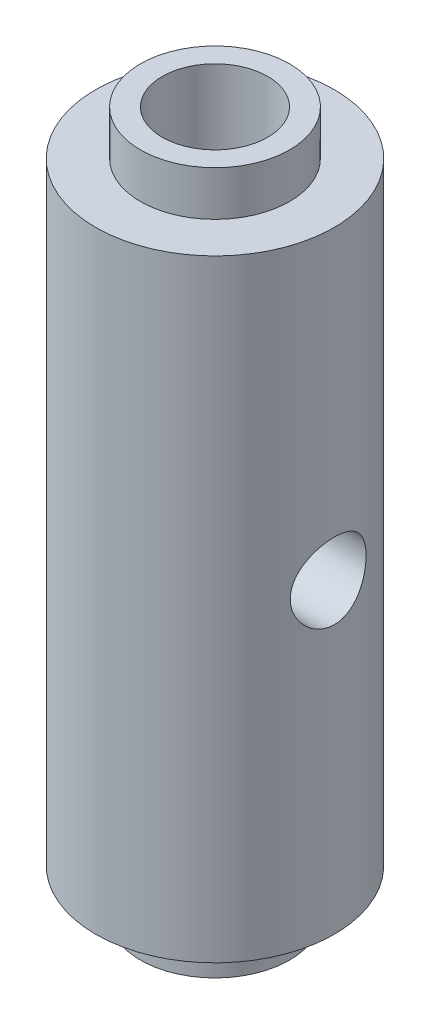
from build123d import *

# Parameters (mm, degrees)
SKETCH12_R         = 2.8067
CUT_EXTRUDE1_DEPTH = 39.402750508


with BuildPart() as part:
    # PostHeight → Height (revolve)
    with BuildSketch(Plane.XY, mode=Mode.PRIVATE) as height_sk:
        Polygon((0, 37.338), (-3.96875, 37.338), (-3.96875, 34.95675), (-6.35, 34.95675), (-6.35, 2.38125), (-3.96875, 2.38125), (-3.96875, 0), (0, 0), align=None)
    revolve(height_sk.sketch.rotate(Axis((0, 0, 0), (0, 1, 0)), 270), axis=Axis((0, 0, 0), (0, 1, 0)))

    # Sketch11 → Cut-Revolve3 (revolve, cut)
    with BuildSketch(Plane(origin=(-6.35, 18.669, 0), x_dir=(0, 0, -1), z_dir=(0, 1, 0)), mode=Mode.PRIVATE) as cut_revolve3_sk:
        Polygon((-2.0193, 0), (-2.0193, -23.8125), (0, -24.886180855), (0, 0), align=None)
    revolve(cut_revolve3_sk.sketch.rotate(Axis((-6.35, 18.669, 0), (-1, 0, 0)), 180), axis=Axis((-6.35, 18.669, 0), (-1, 0, 0)), mode=Mode.SUBTRACT)

    # Sketch12 → Cut-Extrude1 (cut, through all)
    with BuildSketch(Plane(origin=(0, 37.338, 0), x_dir=(-1, 0, 0), z_dir=(0, 1, 0))):
        with Locations(Location((0, 0, 0), (0, 0, 90))):
            Circle(SKETCH12_R)
    extrude(amount=-CUT_EXTRUDE1_DEPTH, mode=Mode.SUBTRACT)


solid = part.part
